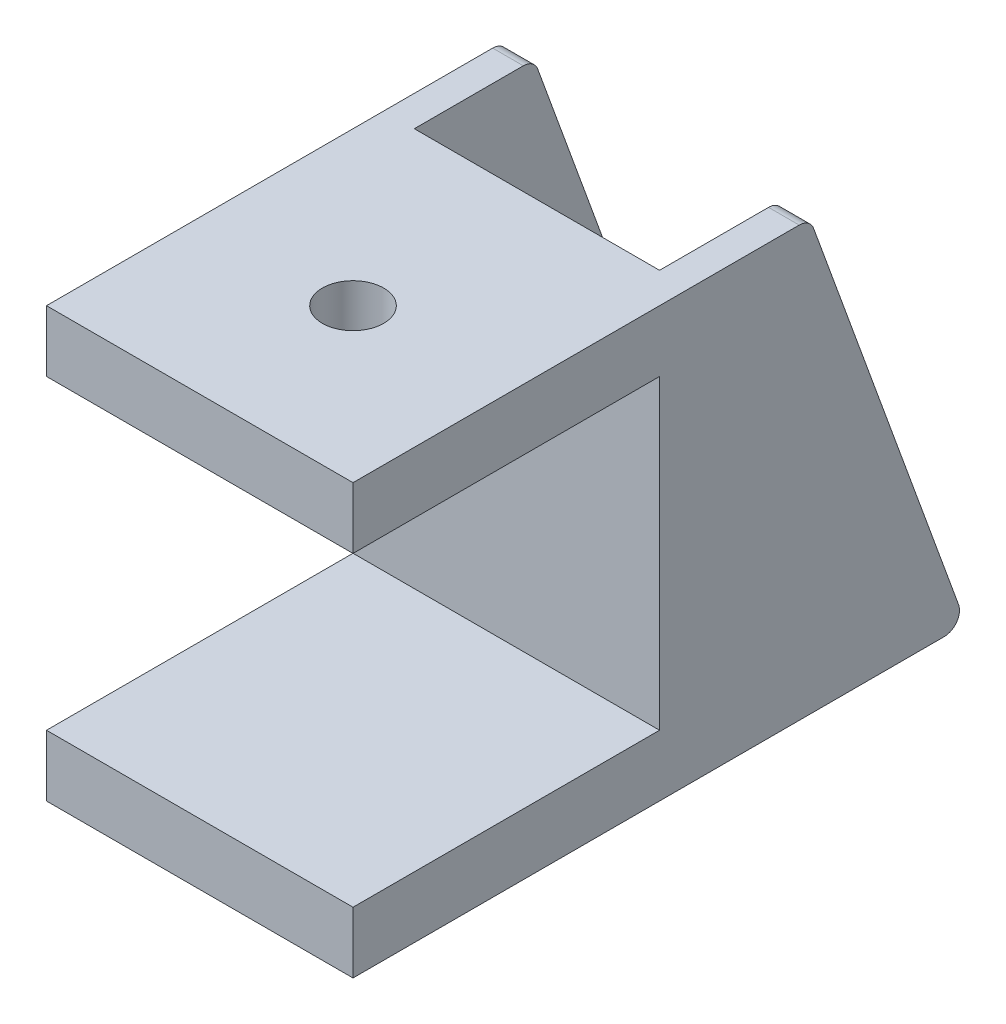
ISO-10303-21;
HEADER;
FILE_DESCRIPTION(('STEP AP214'),'2;1');
FILE_NAME('part.step','',(''),(''),'','','');
FILE_SCHEMA(('AUTOMOTIVE_DESIGN { 1 0 10303 214 1 1 1 1 }'));
ENDSEC;
DATA;
#1=APPLICATION_CONTEXT('core data for automotive mechanical design processes');
#2=APPLICATION_PROTOCOL_DEFINITION('international standard','automotive_design',2000,#1);
#3=PRODUCT_CONTEXT('',#1,'mechanical');
#4=PRODUCT('Part','Part','',(#3));
#5=PRODUCT_RELATED_PRODUCT_CATEGORY('part','',(#4));
#6=PRODUCT_DEFINITION_FORMATION('','',#4);
#7=PRODUCT_DEFINITION_CONTEXT('part definition',#1,'design');
#8=PRODUCT_DEFINITION('design','',#6,#7);
#9=PRODUCT_DEFINITION_SHAPE('','',#8);
#10=(LENGTH_UNIT() NAMED_UNIT(*) SI_UNIT(.MILLI.,.METRE.));
#11=(NAMED_UNIT(*) PLANE_ANGLE_UNIT() SI_UNIT($,.RADIAN.));
#12=(NAMED_UNIT(*) SI_UNIT($,.STERADIAN.) SOLID_ANGLE_UNIT());
#13=UNCERTAINTY_MEASURE_WITH_UNIT(LENGTH_MEASURE(1.E-05),#10,'distance_accuracy_value','');
#14=(GEOMETRIC_REPRESENTATION_CONTEXT(3) GLOBAL_UNCERTAINTY_ASSIGNED_CONTEXT((#13)) GLOBAL_UNIT_ASSIGNED_CONTEXT((#10,
#11,#12)) REPRESENTATION_CONTEXT('',''));
#15=CARTESIAN_POINT('',(0.,0.,0.));
#16=DIRECTION('',(0.,0.,1.));
#17=DIRECTION('',(1.,0.,0.));
#18=AXIS2_PLACEMENT_3D('',#15,#16,#17);
#19=CARTESIAN_POINT('',(20.,23.99,0.));
#20=DIRECTION('',(0.,-1.,0.));
#21=DIRECTION('',(0.,0.,-1.));
#22=AXIS2_PLACEMENT_3D('',#19,#20,#21);
#23=PLANE('',#22);
#24=CARTESIAN_POINT('',(10.,23.99,19.8124731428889));
#25=DIRECTION('',(0.,1.,0.));
#26=DIRECTION('',(0.,0.,1.));
#27=AXIS2_PLACEMENT_3D('',#24,#25,#26);
#28=CIRCLE('',#27,2.);
#29=CARTESIAN_POINT('',(10.,23.99,21.8124731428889));
#30=VERTEX_POINT('',#29);
#31=EDGE_CURVE('E256',#30,#30,#28,.T.);
#32=ORIENTED_EDGE('',*,*,#31,.F.);
#33=EDGE_LOOP('',(#32));
#34=FACE_BOUND('',#33,.T.);
#35=DIRECTION('',(0.,0.,1.));
#36=VECTOR('',#35,1.);
#37=CARTESIAN_POINT('',(20.,23.99,0.));
#38=LINE('',#37,#36);
#39=CARTESIAN_POINT('',(20.,23.99,0.700207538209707));
#40=VERTEX_POINT('',#39);
#41=CARTESIAN_POINT('',(20.,23.99,29.8124731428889));
#42=VERTEX_POINT('',#41);
#43=EDGE_CURVE('E262',#40,#42,#38,.T.);
#44=ORIENTED_EDGE('',*,*,#43,.F.);
#45=DIRECTION('',(-1.,0.,0.));
#46=VECTOR('',#45,1.);
#47=CARTESIAN_POINT('',(20.,23.99,0.700207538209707));
#48=LINE('',#47,#46);
#49=CARTESIAN_POINT('',(18.,23.99,0.700207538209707));
#50=VERTEX_POINT('',#49);
#51=EDGE_CURVE('E353',#40,#50,#48,.T.);
#52=ORIENTED_EDGE('',*,*,#51,.T.);
#53=DIRECTION('',(0.,0.,-1.));
#54=VECTOR('',#53,1.);
#55=CARTESIAN_POINT('',(18.,23.99,-13.1875268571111));
#56=LINE('',#55,#54);
#57=CARTESIAN_POINT('',(18.,23.99,7.81247314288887));
#58=VERTEX_POINT('',#57);
#59=EDGE_CURVE('E240',#58,#50,#56,.T.);
#60=ORIENTED_EDGE('',*,*,#59,.F.);
#61=DIRECTION('',(1.,0.,0.));
#62=VECTOR('',#61,1.);
#63=CARTESIAN_POINT('',(2.,23.99,7.81247314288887));
#64=LINE('',#63,#62);
#65=CARTESIAN_POINT('',(2.,23.99,7.81247314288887));
#66=VERTEX_POINT('',#65);
#67=EDGE_CURVE('E250',#66,#58,#64,.T.);
#68=ORIENTED_EDGE('',*,*,#67,.F.);
#69=DIRECTION('',(0.,0.,1.));
#70=VECTOR('',#69,1.);
#71=CARTESIAN_POINT('',(2.,23.99,-10.1875268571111));
#72=LINE('',#71,#70);
#73=CARTESIAN_POINT('',(2.,23.99,0.700207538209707));
#74=VERTEX_POINT('',#73);
#75=EDGE_CURVE('E235',#74,#66,#72,.T.);
#76=ORIENTED_EDGE('',*,*,#75,.F.);
#77=DIRECTION('',(-1.,0.,0.));
#78=VECTOR('',#77,1.);
#79=CARTESIAN_POINT('',(20.,23.99,0.700207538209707));
#80=LINE('',#79,#78);
#81=CARTESIAN_POINT('',(0.,23.99,0.700207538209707));
#82=VERTEX_POINT('',#81);
#83=EDGE_CURVE('E352',#74,#82,#80,.T.);
#84=ORIENTED_EDGE('',*,*,#83,.T.);
#85=DIRECTION('',(0.,0.,1.));
#86=VECTOR('',#85,1.);
#87=CARTESIAN_POINT('',(0.,23.99,0.));
#88=LINE('',#87,#86);
#89=CARTESIAN_POINT('',(0.,23.99,29.8124731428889));
#90=VERTEX_POINT('',#89);
#91=EDGE_CURVE('E293',#82,#90,#88,.T.);
#92=ORIENTED_EDGE('',*,*,#91,.T.);
#93=DIRECTION('',(-1.,0.,0.));
#94=VECTOR('',#93,1.);
#95=CARTESIAN_POINT('',(20.,23.99,29.8124731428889));
#96=LINE('',#95,#94);
#97=EDGE_CURVE('E334',#42,#90,#96,.T.);
#98=ORIENTED_EDGE('',*,*,#97,.F.);
#99=EDGE_LOOP('',(#44,#52,#60,#68,#76,#84,#92,#98));
#100=FACE_BOUND('',#99,.T.);
#101=ADVANCED_FACE('F44',(#34,#100),#23,.F.);
#102=CARTESIAN_POINT('',(20.,23.99,29.8124731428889));
#103=DIRECTION('',(0.,0.,-1.));
#104=DIRECTION('',(0.,1.,0.));
#105=AXIS2_PLACEMENT_3D('',#102,#103,#104);
#106=PLANE('',#105);
#107=DIRECTION('',(0.,-1.,0.));
#108=VECTOR('',#107,1.);
#109=CARTESIAN_POINT('',(0.,23.99,29.8124731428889));
#110=LINE('',#109,#108);
#111=CARTESIAN_POINT('',(0.,19.99,29.8124731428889));
#112=VERTEX_POINT('',#111);
#113=EDGE_CURVE('E295',#90,#112,#110,.T.);
#114=ORIENTED_EDGE('',*,*,#113,.T.);
#115=DIRECTION('',(-1.,0.,0.));
#116=VECTOR('',#115,1.);
#117=CARTESIAN_POINT('',(20.,19.99,29.8124731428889));
#118=LINE('',#117,#116);
#119=CARTESIAN_POINT('',(20.,19.99,29.8124731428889));
#120=VERTEX_POINT('',#119);
#121=EDGE_CURVE('E329',#120,#112,#118,.T.);
#122=ORIENTED_EDGE('',*,*,#121,.F.);
#123=DIRECTION('',(0.,-1.,0.));
#124=VECTOR('',#123,1.);
#125=CARTESIAN_POINT('',(20.,23.99,29.8124731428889));
#126=LINE('',#125,#124);
#127=EDGE_CURVE('E269',#42,#120,#126,.T.);
#128=ORIENTED_EDGE('',*,*,#127,.F.);
#129=ORIENTED_EDGE('',*,*,#97,.T.);
#130=EDGE_LOOP('',(#114,#122,#128,#129));
#131=FACE_BOUND('',#130,.T.);
#132=ADVANCED_FACE('F421',(#131),#106,.F.);
#133=CARTESIAN_POINT('',(20.,19.99,29.8124731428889));
#134=DIRECTION('',(0.,1.,0.));
#135=DIRECTION('',(0.,0.,1.));
#136=AXIS2_PLACEMENT_3D('',#133,#134,#135);
#137=PLANE('',#136);
#138=CARTESIAN_POINT('',(10.,19.99,19.8124731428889));
#139=DIRECTION('',(0.,1.,0.));
#140=DIRECTION('',(0.,0.,1.));
#141=AXIS2_PLACEMENT_3D('',#138,#139,#140);
#142=CIRCLE('',#141,2.);
#143=CARTESIAN_POINT('',(10.,19.99,21.8124731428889));
#144=VERTEX_POINT('',#143);
#145=EDGE_CURVE('E264',#144,#144,#142,.T.);
#146=ORIENTED_EDGE('',*,*,#145,.T.);
#147=EDGE_LOOP('',(#146));
#148=FACE_BOUND('',#147,.T.);
#149=DIRECTION('',(0.,0.,-1.));
#150=VECTOR('',#149,1.);
#151=CARTESIAN_POINT('',(0.,19.99,29.8124731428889));
#152=LINE('',#151,#150);
#153=CARTESIAN_POINT('',(0.,19.99,9.81247314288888));
#154=VERTEX_POINT('',#153);
#155=EDGE_CURVE('E300',#112,#154,#152,.T.);
#156=ORIENTED_EDGE('',*,*,#155,.T.);
#157=DIRECTION('',(-1.,0.,0.));
#158=VECTOR('',#157,1.);
#159=CARTESIAN_POINT('',(20.,19.99,9.81247314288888));
#160=LINE('',#159,#158);
#161=CARTESIAN_POINT('',(20.,19.99,9.81247314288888));
#162=VERTEX_POINT('',#161);
#163=EDGE_CURVE('E322',#162,#154,#160,.T.);
#164=ORIENTED_EDGE('',*,*,#163,.F.);
#165=DIRECTION('',(0.,0.,-1.));
#166=VECTOR('',#165,1.);
#167=CARTESIAN_POINT('',(20.,19.99,29.8124731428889));
#168=LINE('',#167,#166);
#169=EDGE_CURVE('E275',#120,#162,#168,.T.);
#170=ORIENTED_EDGE('',*,*,#169,.F.);
#171=ORIENTED_EDGE('',*,*,#121,.T.);
#172=EDGE_LOOP('',(#156,#164,#170,#171));
#173=FACE_BOUND('',#172,.T.);
#174=ADVANCED_FACE('F427',(#148,#173),#137,.F.);
#175=CARTESIAN_POINT('',(20.,19.99,9.81247314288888));
#176=DIRECTION('',(0.,0.,-1.));
#177=DIRECTION('',(0.,1.,0.));
#178=AXIS2_PLACEMENT_3D('',#175,#176,#177);
#179=PLANE('',#178);
#180=DIRECTION('',(0.,-1.,0.));
#181=VECTOR('',#180,1.);
#182=CARTESIAN_POINT('',(0.,19.99,9.81247314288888));
#183=LINE('',#182,#181);
#184=CARTESIAN_POINT('',(0.,0.,9.81247314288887));
#185=VERTEX_POINT('',#184);
#186=EDGE_CURVE('E297',#154,#185,#183,.T.);
#187=ORIENTED_EDGE('',*,*,#186,.T.);
#188=DIRECTION('',(-1.,0.,0.));
#189=VECTOR('',#188,1.);
#190=CARTESIAN_POINT('',(20.,0.,9.81247314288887));
#191=LINE('',#190,#189);
#192=CARTESIAN_POINT('',(20.,0.,9.81247314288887));
#193=VERTEX_POINT('',#192);
#194=EDGE_CURVE('E324',#193,#185,#191,.T.);
#195=ORIENTED_EDGE('',*,*,#194,.F.);
#196=DIRECTION('',(0.,-1.,0.));
#197=VECTOR('',#196,1.);
#198=CARTESIAN_POINT('',(20.,19.99,9.81247314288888));
#199=LINE('',#198,#197);
#200=EDGE_CURVE('E273',#162,#193,#199,.T.);
#201=ORIENTED_EDGE('',*,*,#200,.F.);
#202=ORIENTED_EDGE('',*,*,#163,.T.);
#203=EDGE_LOOP('',(#187,#195,#201,#202));
#204=FACE_BOUND('',#203,.T.);
#205=ADVANCED_FACE('F432',(#204),#179,.F.);
#206=CARTESIAN_POINT('',(20.,0.,9.81247314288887));
#207=DIRECTION('',(0.,-1.,0.));
#208=DIRECTION('',(0.,0.,-1.));
#209=AXIS2_PLACEMENT_3D('',#206,#207,#208);
#210=PLANE('',#209);
#211=DIRECTION('',(0.,0.,1.));
#212=VECTOR('',#211,1.);
#213=CARTESIAN_POINT('',(0.,0.,9.81247314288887));
#214=LINE('',#213,#212);
#215=CARTESIAN_POINT('',(0.,0.,29.8124731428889));
#216=VERTEX_POINT('',#215);
#217=EDGE_CURVE('E303',#185,#216,#214,.T.);
#218=ORIENTED_EDGE('',*,*,#217,.T.);
#219=DIRECTION('',(-1.,0.,0.));
#220=VECTOR('',#219,1.);
#221=CARTESIAN_POINT('',(20.,0.,29.8124731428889));
#222=LINE('',#221,#220);
#223=CARTESIAN_POINT('',(20.,0.,29.8124731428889));
#224=VERTEX_POINT('',#223);
#225=EDGE_CURVE('E320',#224,#216,#222,.T.);
#226=ORIENTED_EDGE('',*,*,#225,.F.);
#227=DIRECTION('',(0.,0.,1.));
#228=VECTOR('',#227,1.);
#229=CARTESIAN_POINT('',(20.,0.,9.81247314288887));
#230=LINE('',#229,#228);
#231=EDGE_CURVE('E280',#193,#224,#230,.T.);
#232=ORIENTED_EDGE('',*,*,#231,.F.);
#233=ORIENTED_EDGE('',*,*,#194,.T.);
#234=EDGE_LOOP('',(#218,#226,#232,#233));
#235=FACE_BOUND('',#234,.T.);
#236=ADVANCED_FACE('F437',(#235),#210,.F.);
#237=CARTESIAN_POINT('',(20.,0.,29.8124731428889));
#238=DIRECTION('',(0.,0.,-1.));
#239=DIRECTION('',(-1.,0.,0.));
#240=AXIS2_PLACEMENT_3D('',#237,#238,#239);
#241=PLANE('',#240);
#242=DIRECTION('',(0.,-1.,0.));
#243=VECTOR('',#242,1.);
#244=CARTESIAN_POINT('',(0.,0.,29.8124731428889));
#245=LINE('',#244,#243);
#246=CARTESIAN_POINT('',(0.,-4.00000000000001,29.8124731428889));
#247=VERTEX_POINT('',#246);
#248=EDGE_CURVE('E306',#216,#247,#245,.T.);
#249=ORIENTED_EDGE('',*,*,#248,.T.);
#250=DIRECTION('',(-1.,0.,0.));
#251=VECTOR('',#250,1.);
#252=CARTESIAN_POINT('',(20.,-4.00000000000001,29.8124731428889));
#253=LINE('',#252,#251);
#254=CARTESIAN_POINT('',(20.,-4.00000000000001,29.8124731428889));
#255=VERTEX_POINT('',#254);
#256=EDGE_CURVE('E288',#255,#247,#253,.T.);
#257=ORIENTED_EDGE('',*,*,#256,.F.);
#258=DIRECTION('',(0.,-1.,0.));
#259=VECTOR('',#258,1.);
#260=CARTESIAN_POINT('',(20.,0.,29.8124731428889));
#261=LINE('',#260,#259);
#262=EDGE_CURVE('E283',#224,#255,#261,.T.);
#263=ORIENTED_EDGE('',*,*,#262,.F.);
#264=ORIENTED_EDGE('',*,*,#225,.T.);
#265=EDGE_LOOP('',(#249,#257,#263,#264));
#266=FACE_BOUND('',#265,.T.);
#267=ADVANCED_FACE('F442',(#266),#241,.F.);
#268=CARTESIAN_POINT('',(20.,-4.00000000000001,29.8124731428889));
#269=DIRECTION('',(0.,1.,0.));
#270=DIRECTION('',(0.,0.,1.));
#271=AXIS2_PLACEMENT_3D('',#268,#269,#270);
#272=PLANE('',#271);
#273=DIRECTION('',(0.,0.,-1.));
#274=VECTOR('',#273,1.);
#275=CARTESIAN_POINT('',(14.1,-4.00000000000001,29.8124731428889));
#276=LINE('',#275,#274);
#277=CARTESIAN_POINT('',(14.1,-4.00000000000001,3.27247314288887));
#278=VERTEX_POINT('',#277);
#279=CARTESIAN_POINT('',(14.1,-4.00000000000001,-2.72752685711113));
#280=VERTEX_POINT('',#279);
#281=EDGE_CURVE('E221',#278,#280,#276,.T.);
#282=ORIENTED_EDGE('',*,*,#281,.T.);
#283=CARTESIAN_POINT('',(10.,-4.00000000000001,-2.72752685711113));
#284=DIRECTION('',(0.,1.,0.));
#285=DIRECTION('',(0.,0.,1.));
#286=AXIS2_PLACEMENT_3D('',#283,#284,#285);
#287=CIRCLE('',#286,4.1);
#288=CARTESIAN_POINT('',(5.9,-4.00000000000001,-2.72752685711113));
#289=VERTEX_POINT('',#288);
#290=EDGE_CURVE('E226',#280,#289,#287,.T.);
#291=ORIENTED_EDGE('',*,*,#290,.T.);
#292=DIRECTION('',(0.,0.,1.));
#293=VECTOR('',#292,1.);
#294=CARTESIAN_POINT('',(5.90000000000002,-4.00000000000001,29.8124731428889));
#295=LINE('',#294,#293);
#296=CARTESIAN_POINT('',(5.9,-4.00000000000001,3.27247314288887));
#297=VERTEX_POINT('',#296);
#298=EDGE_CURVE('E212',#289,#297,#295,.T.);
#299=ORIENTED_EDGE('',*,*,#298,.T.);
#300=CARTESIAN_POINT('',(10.,-4.00000000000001,3.27247314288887));
#301=DIRECTION('',(0.,1.,0.));
#302=DIRECTION('',(0.,0.,1.));
#303=AXIS2_PLACEMENT_3D('',#300,#301,#302);
#304=CIRCLE('',#303,4.1);
#305=EDGE_CURVE('E184',#297,#278,#304,.T.);
#306=ORIENTED_EDGE('',*,*,#305,.T.);
#307=EDGE_LOOP('',(#282,#291,#299,#306));
#308=FACE_BOUND('',#307,.T.);
#309=DIRECTION('',(0.,0.,-1.));
#310=VECTOR('',#309,1.);
#311=CARTESIAN_POINT('',(0.,-4.00000000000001,29.8124731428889));
#312=LINE('',#311,#310);
#313=CARTESIAN_POINT('',(0.,-4.00000000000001,-8.75937885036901));
#314=VERTEX_POINT('',#313);
#315=EDGE_CURVE('E307',#247,#314,#312,.T.);
#316=ORIENTED_EDGE('',*,*,#315,.T.);
#317=DIRECTION('',(-1.,0.,0.));
#318=VECTOR('',#317,1.);
#319=CARTESIAN_POINT('',(20.,-4.00000000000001,-8.75937885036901));
#320=LINE('',#319,#318);
#321=CARTESIAN_POINT('',(20.,-4.00000000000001,-8.75937885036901));
#322=VERTEX_POINT('',#321);
#323=EDGE_CURVE('E53',#314,#322,#320,.F.);
#324=ORIENTED_EDGE('',*,*,#323,.T.);
#325=DIRECTION('',(0.,0.,-1.));
#326=VECTOR('',#325,1.);
#327=CARTESIAN_POINT('',(20.,-4.00000000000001,29.8124731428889));
#328=LINE('',#327,#326);
#329=EDGE_CURVE('E284',#255,#322,#328,.T.);
#330=ORIENTED_EDGE('',*,*,#329,.F.);
#331=ORIENTED_EDGE('',*,*,#256,.T.);
#332=EDGE_LOOP('',(#316,#324,#330,#331));
#333=FACE_BOUND('',#332,.T.);
#334=ADVANCED_FACE('F444',(#308,#333),#272,.F.);
#335=CARTESIAN_POINT('',(20.,-4.00000000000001,-10.1875268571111));
#336=DIRECTION('',(0.,-0.342020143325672,0.939692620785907));
#337=DIRECTION('',(0.,-0.939692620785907,-0.342020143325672));
#338=AXIS2_PLACEMENT_3D('',#335,#336,#337);
#339=PLANE('',#338);
#340=DIRECTION('',(0.,0.939692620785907,0.342020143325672));
#341=VECTOR('',#340,1.);
#342=CARTESIAN_POINT('',(20.,-4.00000000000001,-10.1875268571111));
#343=LINE('',#342,#341);
#344=CARTESIAN_POINT('',(20.,-2.65797985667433,-9.69907147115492));
#345=VERTEX_POINT('',#344);
#346=CARTESIAN_POINT('',(20.,23.3320201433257,-0.2394850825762));
#347=VERTEX_POINT('',#346);
#348=EDGE_CURVE('E290',#345,#347,#343,.T.);
#349=ORIENTED_EDGE('',*,*,#348,.F.);
#350=DIRECTION('',(-1.,0.,0.));
#351=VECTOR('',#350,1.);
#352=CARTESIAN_POINT('',(20.,-2.65797985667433,-9.69907147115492));
#353=LINE('',#352,#351);
#354=CARTESIAN_POINT('',(0.,-2.65797985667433,-9.69907147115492));
#355=VERTEX_POINT('',#354);
#356=EDGE_CURVE('E378',#345,#355,#353,.T.);
#357=ORIENTED_EDGE('',*,*,#356,.T.);
#358=DIRECTION('',(0.,0.939692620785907,0.342020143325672));
#359=VECTOR('',#358,1.);
#360=CARTESIAN_POINT('',(0.,-4.00000000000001,-10.1875268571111));
#361=LINE('',#360,#359);
#362=CARTESIAN_POINT('',(0.,23.3320201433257,-0.2394850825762));
#363=VERTEX_POINT('',#362);
#364=EDGE_CURVE('E266',#355,#363,#361,.T.);
#365=ORIENTED_EDGE('',*,*,#364,.T.);
#366=DIRECTION('',(-1.,0.,0.));
#367=VECTOR('',#366,1.);
#368=CARTESIAN_POINT('',(20.,23.3320201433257,-0.2394850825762));
#369=LINE('',#368,#367);
#370=CARTESIAN_POINT('',(2.,23.3320201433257,-0.2394850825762));
#371=VERTEX_POINT('',#370);
#372=EDGE_CURVE('E365',#363,#371,#369,.F.);
#373=ORIENTED_EDGE('',*,*,#372,.T.);
#374=DIRECTION('',(0.,-0.939692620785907,-0.342020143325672));
#375=VECTOR('',#374,1.);
#376=CARTESIAN_POINT('',(2.,-4.00000000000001,-10.1875268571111));
#377=LINE('',#376,#375);
#378=CARTESIAN_POINT('',(2.,3.99,-7.27940468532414));
#379=VERTEX_POINT('',#378);
#380=EDGE_CURVE('E343',#371,#379,#377,.T.);
#381=ORIENTED_EDGE('',*,*,#380,.T.);
#382=DIRECTION('',(1.,0.,0.));
#383=VECTOR('',#382,1.);
#384=CARTESIAN_POINT('',(20.,3.99,-7.27940468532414));
#385=LINE('',#384,#383);
#386=CARTESIAN_POINT('',(18.,3.99,-7.27940468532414));
#387=VERTEX_POINT('',#386);
#388=EDGE_CURVE('E340',#379,#387,#385,.T.);
#389=ORIENTED_EDGE('',*,*,#388,.T.);
#390=DIRECTION('',(0.,0.939692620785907,0.342020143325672));
#391=VECTOR('',#390,1.);
#392=CARTESIAN_POINT('',(18.,-4.00000000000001,-10.1875268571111));
#393=LINE('',#392,#391);
#394=CARTESIAN_POINT('',(18.,23.3320201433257,-0.239485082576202));
#395=VERTEX_POINT('',#394);
#396=EDGE_CURVE('E350',#387,#395,#393,.T.);
#397=ORIENTED_EDGE('',*,*,#396,.T.);
#398=DIRECTION('',(-1.,0.,0.));
#399=VECTOR('',#398,1.);
#400=CARTESIAN_POINT('',(20.,23.3320201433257,-0.2394850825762));
#401=LINE('',#400,#399);
#402=EDGE_CURVE('E362',#395,#347,#401,.F.);
#403=ORIENTED_EDGE('',*,*,#402,.T.);
#404=EDGE_LOOP('',(#349,#357,#365,#373,#381,#389,#397,#403));
#405=FACE_BOUND('',#404,.T.);
#406=ADVANCED_FACE('F390',(#405),#339,.F.);
#407=CARTESIAN_POINT('',(20.,0.,0.));
#408=DIRECTION('',(1.,0.,0.));
#409=DIRECTION('',(0.,0.,-1.));
#410=AXIS2_PLACEMENT_3D('',#407,#408,#409);
#411=PLANE('',#410);
#412=ORIENTED_EDGE('',*,*,#329,.T.);
#413=CARTESIAN_POINT('',(20.,-3.00000000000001,-8.75937885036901));
#414=DIRECTION('',(1.,0.,0.));
#415=DIRECTION('',(0.,0.,-1.));
#416=AXIS2_PLACEMENT_3D('',#413,#414,#415);
#417=CIRCLE('',#416,1.);
#418=EDGE_CURVE('E11',#322,#345,#417,.T.);
#419=ORIENTED_EDGE('',*,*,#418,.T.);
#420=ORIENTED_EDGE('',*,*,#348,.T.);
#421=CARTESIAN_POINT('',(20.,22.99,0.700207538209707));
#422=DIRECTION('',(1.,0.,0.));
#423=DIRECTION('',(0.,0.,-1.));
#424=AXIS2_PLACEMENT_3D('',#421,#422,#423);
#425=CIRCLE('',#424,1.);
#426=EDGE_CURVE('E367',#347,#40,#425,.T.);
#427=ORIENTED_EDGE('',*,*,#426,.T.);
#428=ORIENTED_EDGE('',*,*,#43,.T.);
#429=ORIENTED_EDGE('',*,*,#127,.T.);
#430=ORIENTED_EDGE('',*,*,#169,.T.);
#431=ORIENTED_EDGE('',*,*,#200,.T.);
#432=ORIENTED_EDGE('',*,*,#231,.T.);
#433=ORIENTED_EDGE('',*,*,#262,.T.);
#434=EDGE_LOOP('',(#412,#419,#420,#427,#428,#429,#430,#431,#432,#433));
#435=FACE_BOUND('',#434,.T.);
#436=ADVANCED_FACE('F420',(#435),#411,.T.);
#437=CARTESIAN_POINT('',(0.,0.,0.));
#438=DIRECTION('',(1.,0.,0.));
#439=DIRECTION('',(0.,0.,-1.));
#440=AXIS2_PLACEMENT_3D('',#437,#438,#439);
#441=PLANE('',#440);
#442=ORIENTED_EDGE('',*,*,#364,.F.);
#443=CARTESIAN_POINT('',(0.,-3.00000000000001,-8.75937885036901));
#444=DIRECTION('',(1.,0.,0.));
#445=DIRECTION('',(0.,0.,-1.));
#446=AXIS2_PLACEMENT_3D('',#443,#444,#445);
#447=CIRCLE('',#446,1.);
#448=EDGE_CURVE('E66',#355,#314,#447,.F.);
#449=ORIENTED_EDGE('',*,*,#448,.T.);
#450=ORIENTED_EDGE('',*,*,#315,.F.);
#451=ORIENTED_EDGE('',*,*,#248,.F.);
#452=ORIENTED_EDGE('',*,*,#217,.F.);
#453=ORIENTED_EDGE('',*,*,#186,.F.);
#454=ORIENTED_EDGE('',*,*,#155,.F.);
#455=ORIENTED_EDGE('',*,*,#113,.F.);
#456=ORIENTED_EDGE('',*,*,#91,.F.);
#457=CARTESIAN_POINT('',(0.,22.99,0.700207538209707));
#458=DIRECTION('',(1.,0.,0.));
#459=DIRECTION('',(0.,0.,-1.));
#460=AXIS2_PLACEMENT_3D('',#457,#458,#459);
#461=CIRCLE('',#460,1.);
#462=EDGE_CURVE('E375',#82,#363,#461,.F.);
#463=ORIENTED_EDGE('',*,*,#462,.T.);
#464=EDGE_LOOP('',(#442,#449,#450,#451,#452,#453,#454,#455,#456,#463));
#465=FACE_BOUND('',#464,.T.);
#466=ADVANCED_FACE('F393',(#465),#441,.F.);
#467=CARTESIAN_POINT('',(10.,18.99,19.8124731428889));
#468=DIRECTION('',(0.,1.,0.));
#469=DIRECTION('',(0.,0.,1.));
#470=AXIS2_PLACEMENT_3D('',#467,#468,#469);
#471=CYLINDRICAL_SURFACE('',#470,2.);
#472=ORIENTED_EDGE('',*,*,#31,.T.);
#473=EDGE_LOOP('',(#472));
#474=FACE_BOUND('',#473,.T.);
#475=ORIENTED_EDGE('',*,*,#145,.F.);
#476=EDGE_LOOP('',(#475));
#477=FACE_BOUND('',#476,.T.);
#478=ADVANCED_FACE('F489',(#474,#477),#471,.F.);
#479=CARTESIAN_POINT('',(18.,3.99,-13.1875268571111));
#480=DIRECTION('',(1.,0.,0.));
#481=DIRECTION('',(0.,0.,-1.));
#482=AXIS2_PLACEMENT_3D('',#479,#480,#481);
#483=PLANE('',#482);
#484=ORIENTED_EDGE('',*,*,#59,.T.);
#485=CARTESIAN_POINT('',(18.,22.99,0.700207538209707));
#486=DIRECTION('',(1.,0.,0.));
#487=DIRECTION('',(0.,0.,-1.));
#488=AXIS2_PLACEMENT_3D('',#485,#486,#487);
#489=CIRCLE('',#488,1.);
#490=EDGE_CURVE('E360',#50,#395,#489,.F.);
#491=ORIENTED_EDGE('',*,*,#490,.T.);
#492=ORIENTED_EDGE('',*,*,#396,.F.);
#493=DIRECTION('',(0.,0.,-1.));
#494=VECTOR('',#493,1.);
#495=CARTESIAN_POINT('',(18.,3.98999999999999,7.81247314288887));
#496=LINE('',#495,#494);
#497=CARTESIAN_POINT('',(18.,3.98999999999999,7.81247314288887));
#498=VERTEX_POINT('',#497);
#499=EDGE_CURVE('E241',#498,#387,#496,.T.);
#500=ORIENTED_EDGE('',*,*,#499,.F.);
#501=DIRECTION('',(0.,1.,0.));
#502=VECTOR('',#501,1.);
#503=CARTESIAN_POINT('',(18.,3.98999999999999,7.81247314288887));
#504=LINE('',#503,#502);
#505=EDGE_CURVE('E251',#498,#58,#504,.T.);
#506=ORIENTED_EDGE('',*,*,#505,.T.);
#507=EDGE_LOOP('',(#484,#491,#492,#500,#506));
#508=FACE_BOUND('',#507,.T.);
#509=ADVANCED_FACE('F486',(#508),#483,.F.);
#510=CARTESIAN_POINT('',(2.,3.99,-10.1875268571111));
#511=DIRECTION('',(-1.,0.,0.));
#512=DIRECTION('',(0.,0.,1.));
#513=AXIS2_PLACEMENT_3D('',#510,#511,#512);
#514=PLANE('',#513);
#515=ORIENTED_EDGE('',*,*,#380,.F.);
#516=CARTESIAN_POINT('',(2.,22.99,0.700207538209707));
#517=DIRECTION('',(-1.,0.,0.));
#518=DIRECTION('',(0.,0.,1.));
#519=AXIS2_PLACEMENT_3D('',#516,#517,#518);
#520=CIRCLE('',#519,1.);
#521=EDGE_CURVE('E376',#371,#74,#520,.F.);
#522=ORIENTED_EDGE('',*,*,#521,.T.);
#523=ORIENTED_EDGE('',*,*,#75,.T.);
#524=DIRECTION('',(0.,1.,0.));
#525=VECTOR('',#524,1.);
#526=CARTESIAN_POINT('',(2.,3.98999999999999,7.81247314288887));
#527=LINE('',#526,#525);
#528=CARTESIAN_POINT('',(2.,3.98999999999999,7.81247314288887));
#529=VERTEX_POINT('',#528);
#530=EDGE_CURVE('E242',#529,#66,#527,.T.);
#531=ORIENTED_EDGE('',*,*,#530,.F.);
#532=DIRECTION('',(0.,0.,1.));
#533=VECTOR('',#532,1.);
#534=CARTESIAN_POINT('',(2.,3.99,-10.1875268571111));
#535=LINE('',#534,#533);
#536=EDGE_CURVE('E231',#379,#529,#535,.T.);
#537=ORIENTED_EDGE('',*,*,#536,.F.);
#538=EDGE_LOOP('',(#515,#522,#523,#531,#537));
#539=FACE_BOUND('',#538,.T.);
#540=ADVANCED_FACE('F401',(#539),#514,.F.);
#541=CARTESIAN_POINT('',(0.,3.99,0.));
#542=DIRECTION('',(0.,-1.,0.));
#543=DIRECTION('',(0.,0.,-1.));
#544=AXIS2_PLACEMENT_3D('',#541,#542,#543);
#545=PLANE('',#544);
#546=DIRECTION('',(0.,0.,1.));
#547=VECTOR('',#546,1.);
#548=CARTESIAN_POINT('',(5.9,3.99,-2.72752685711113));
#549=LINE('',#548,#547);
#550=CARTESIAN_POINT('',(5.9,3.99,-2.72752685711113));
#551=VERTEX_POINT('',#550);
#552=CARTESIAN_POINT('',(5.9,3.99,3.27247314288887));
#553=VERTEX_POINT('',#552);
#554=EDGE_CURVE('E193',#551,#553,#549,.T.);
#555=ORIENTED_EDGE('',*,*,#554,.F.);
#556=CARTESIAN_POINT('',(10.,3.99,-2.72752685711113));
#557=DIRECTION('',(0.,1.,0.));
#558=DIRECTION('',(0.,0.,1.));
#559=AXIS2_PLACEMENT_3D('',#556,#557,#558);
#560=CIRCLE('',#559,4.1);
#561=CARTESIAN_POINT('',(14.1,3.99,-2.72752685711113));
#562=VERTEX_POINT('',#561);
#563=EDGE_CURVE('E197',#562,#551,#560,.T.);
#564=ORIENTED_EDGE('',*,*,#563,.F.);
#565=DIRECTION('',(0.,0.,-1.));
#566=VECTOR('',#565,1.);
#567=CARTESIAN_POINT('',(14.1,3.99,-2.72752685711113));
#568=LINE('',#567,#566);
#569=CARTESIAN_POINT('',(14.1,3.99,3.27247314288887));
#570=VERTEX_POINT('',#569);
#571=EDGE_CURVE('E203',#570,#562,#568,.T.);
#572=ORIENTED_EDGE('',*,*,#571,.F.);
#573=CARTESIAN_POINT('',(10.,3.99,3.27247314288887));
#574=DIRECTION('',(0.,1.,0.));
#575=DIRECTION('',(0.,0.,1.));
#576=AXIS2_PLACEMENT_3D('',#573,#574,#575);
#577=CIRCLE('',#576,4.1);
#578=EDGE_CURVE('E185',#553,#570,#577,.T.);
#579=ORIENTED_EDGE('',*,*,#578,.F.);
#580=EDGE_LOOP('',(#555,#564,#572,#579));
#581=FACE_BOUND('',#580,.T.);
#582=ORIENTED_EDGE('',*,*,#536,.T.);
#583=DIRECTION('',(1.,0.,0.));
#584=VECTOR('',#583,1.);
#585=CARTESIAN_POINT('',(2.,3.98999999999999,7.81247314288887));
#586=LINE('',#585,#584);
#587=EDGE_CURVE('E236',#529,#498,#586,.T.);
#588=ORIENTED_EDGE('',*,*,#587,.T.);
#589=ORIENTED_EDGE('',*,*,#499,.T.);
#590=ORIENTED_EDGE('',*,*,#388,.F.);
#591=EDGE_LOOP('',(#582,#588,#589,#590));
#592=FACE_BOUND('',#591,.T.);
#593=ADVANCED_FACE('F205',(#581,#592),#545,.F.);
#594=CARTESIAN_POINT('',(2.,3.98999999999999,7.81247314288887));
#595=DIRECTION('',(0.,0.,1.));
#596=DIRECTION('',(0.,-1.,0.));
#597=AXIS2_PLACEMENT_3D('',#594,#595,#596);
#598=PLANE('',#597);
#599=ORIENTED_EDGE('',*,*,#67,.T.);
#600=ORIENTED_EDGE('',*,*,#505,.F.);
#601=ORIENTED_EDGE('',*,*,#587,.F.);
#602=ORIENTED_EDGE('',*,*,#530,.T.);
#603=EDGE_LOOP('',(#599,#600,#601,#602));
#604=FACE_BOUND('',#603,.T.);
#605=ADVANCED_FACE('F469',(#604),#598,.F.);
#606=CARTESIAN_POINT('',(20.,22.99,0.700207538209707));
#607=DIRECTION('',(-1.,0.,0.));
#608=DIRECTION('',(0.,0.,1.));
#609=AXIS2_PLACEMENT_3D('',#606,#607,#608);
#610=CYLINDRICAL_SURFACE('',#609,1.);
#611=ORIENTED_EDGE('',*,*,#426,.F.);
#612=ORIENTED_EDGE('',*,*,#402,.F.);
#613=ORIENTED_EDGE('',*,*,#490,.F.);
#614=ORIENTED_EDGE('',*,*,#51,.F.);
#615=EDGE_LOOP('',(#611,#612,#613,#614));
#616=FACE_BOUND('',#615,.T.);
#617=ADVANCED_FACE('F411',(#616),#610,.T.);
#618=CARTESIAN_POINT('',(20.,22.99,0.700207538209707));
#619=DIRECTION('',(-1.,0.,0.));
#620=DIRECTION('',(0.,0.,1.));
#621=AXIS2_PLACEMENT_3D('',#618,#619,#620);
#622=CYLINDRICAL_SURFACE('',#621,1.);
#623=ORIENTED_EDGE('',*,*,#521,.F.);
#624=ORIENTED_EDGE('',*,*,#372,.F.);
#625=ORIENTED_EDGE('',*,*,#462,.F.);
#626=ORIENTED_EDGE('',*,*,#83,.F.);
#627=EDGE_LOOP('',(#623,#624,#625,#626));
#628=FACE_BOUND('',#627,.T.);
#629=ADVANCED_FACE('F399',(#628),#622,.T.);
#630=CARTESIAN_POINT('',(10.,-16.01,-2.72752685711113));
#631=DIRECTION('',(0.,1.,0.));
#632=DIRECTION('',(0.,0.,1.));
#633=AXIS2_PLACEMENT_3D('',#630,#631,#632);
#634=CYLINDRICAL_SURFACE('',#633,4.1);
#635=DIRECTION('',(0.,1.,0.));
#636=VECTOR('',#635,1.);
#637=CARTESIAN_POINT('',(14.1,-16.01,-2.72752685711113));
#638=LINE('',#637,#636);
#639=EDGE_CURVE('E211',#280,#562,#638,.T.);
#640=ORIENTED_EDGE('',*,*,#639,.T.);
#641=ORIENTED_EDGE('',*,*,#563,.T.);
#642=DIRECTION('',(0.,1.,0.));
#643=VECTOR('',#642,1.);
#644=CARTESIAN_POINT('',(5.9,-16.01,-2.72752685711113));
#645=LINE('',#644,#643);
#646=EDGE_CURVE('E188',#289,#551,#645,.T.);
#647=ORIENTED_EDGE('',*,*,#646,.F.);
#648=ORIENTED_EDGE('',*,*,#290,.F.);
#649=EDGE_LOOP('',(#640,#641,#647,#648));
#650=FACE_BOUND('',#649,.T.);
#651=ADVANCED_FACE('F474',(#650),#634,.F.);
#652=CARTESIAN_POINT('',(14.1,-16.01,-2.72752685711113));
#653=DIRECTION('',(1.,0.,0.));
#654=DIRECTION('',(0.,0.,-1.));
#655=AXIS2_PLACEMENT_3D('',#652,#653,#654);
#656=PLANE('',#655);
#657=DIRECTION('',(0.,1.,0.));
#658=VECTOR('',#657,1.);
#659=CARTESIAN_POINT('',(14.1,-16.01,3.27247314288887));
#660=LINE('',#659,#658);
#661=EDGE_CURVE('E186',#278,#570,#660,.T.);
#662=ORIENTED_EDGE('',*,*,#661,.T.);
#663=ORIENTED_EDGE('',*,*,#571,.T.);
#664=ORIENTED_EDGE('',*,*,#639,.F.);
#665=ORIENTED_EDGE('',*,*,#281,.F.);
#666=EDGE_LOOP('',(#662,#663,#664,#665));
#667=FACE_BOUND('',#666,.T.);
#668=ADVANCED_FACE('F478',(#667),#656,.F.);
#669=CARTESIAN_POINT('',(10.,-16.01,3.27247314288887));
#670=DIRECTION('',(0.,1.,0.));
#671=DIRECTION('',(0.,0.,1.));
#672=AXIS2_PLACEMENT_3D('',#669,#670,#671);
#673=CYLINDRICAL_SURFACE('',#672,4.1);
#674=DIRECTION('',(0.,1.,0.));
#675=VECTOR('',#674,1.);
#676=CARTESIAN_POINT('',(5.9,-16.01,3.27247314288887));
#677=LINE('',#676,#675);
#678=EDGE_CURVE('E180',#297,#553,#677,.T.);
#679=ORIENTED_EDGE('',*,*,#678,.T.);
#680=ORIENTED_EDGE('',*,*,#578,.T.);
#681=ORIENTED_EDGE('',*,*,#661,.F.);
#682=ORIENTED_EDGE('',*,*,#305,.F.);
#683=EDGE_LOOP('',(#679,#680,#681,#682));
#684=FACE_BOUND('',#683,.T.);
#685=ADVANCED_FACE('F177',(#684),#673,.F.);
#686=CARTESIAN_POINT('',(5.9,-16.01,-2.72752685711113));
#687=DIRECTION('',(-1.,0.,0.));
#688=DIRECTION('',(0.,0.,1.));
#689=AXIS2_PLACEMENT_3D('',#686,#687,#688);
#690=PLANE('',#689);
#691=ORIENTED_EDGE('',*,*,#646,.T.);
#692=ORIENTED_EDGE('',*,*,#554,.T.);
#693=ORIENTED_EDGE('',*,*,#678,.F.);
#694=ORIENTED_EDGE('',*,*,#298,.F.);
#695=EDGE_LOOP('',(#691,#692,#693,#694));
#696=FACE_BOUND('',#695,.T.);
#697=ADVANCED_FACE('F192',(#696),#690,.F.);
#698=CARTESIAN_POINT('',(20.,-3.00000000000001,-8.75937885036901));
#699=DIRECTION('',(-1.,0.,0.));
#700=DIRECTION('',(0.,0.,1.));
#701=AXIS2_PLACEMENT_3D('',#698,#699,#700);
#702=CYLINDRICAL_SURFACE('',#701,1.);
#703=ORIENTED_EDGE('',*,*,#418,.F.);
#704=ORIENTED_EDGE('',*,*,#323,.F.);
#705=ORIENTED_EDGE('',*,*,#448,.F.);
#706=ORIENTED_EDGE('',*,*,#356,.F.);
#707=EDGE_LOOP('',(#703,#704,#705,#706));
#708=FACE_BOUND('',#707,.T.);
#709=ADVANCED_FACE('F50',(#708),#702,.T.);
#710=CLOSED_SHELL('',(#101,#132,#174,#205,#236,#267,#334,#406,#436,#466,#478,#509,#540,#593,
#605,#617,#629,#651,#668,#685,#697,#709));
#711=MANIFOLD_SOLID_BREP('B2',#710);
#712=ADVANCED_BREP_SHAPE_REPRESENTATION('',(#18,#711),#14);
#713=SHAPE_DEFINITION_REPRESENTATION(#9,#712);
ENDSEC;
END-ISO-10303-21;
